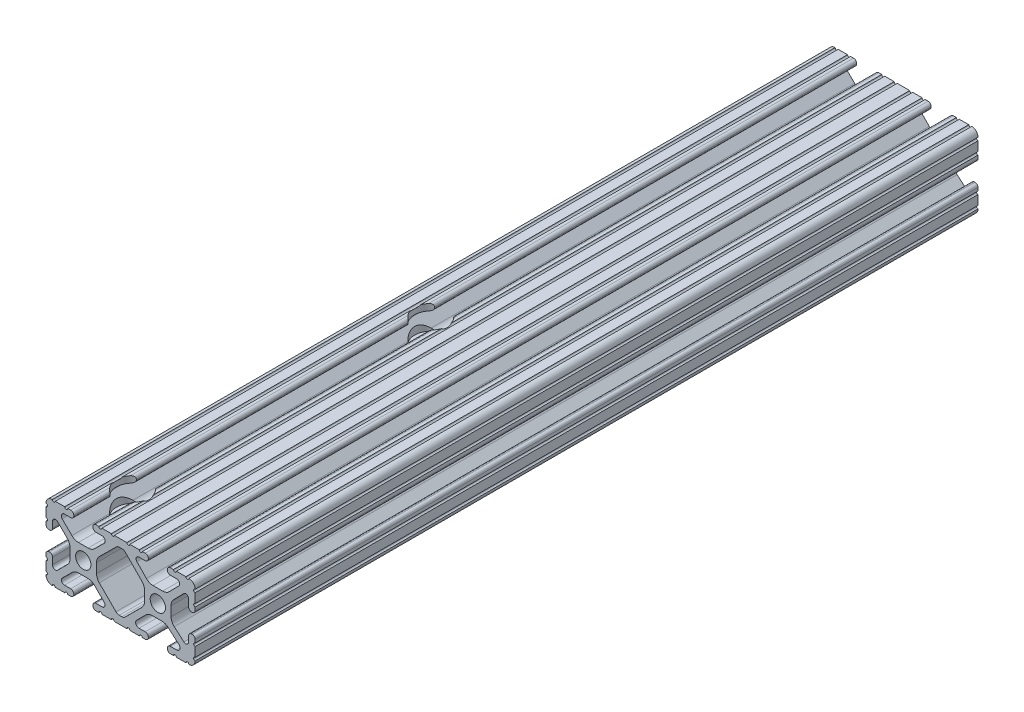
from build123d import *

# Parameters (mm, degrees)
SKETCH1_R                                        = 2.6035
BOSS_EXTRUDE1_DEPTH                              = 133.35
CBORE_FOR_1_4_SOCKET_HEAD_CAP_SCREW1_D           = 6.7564
CBORE_FOR_1_4_SOCKET_HEAD_CAP_SCREW1_CBORE_D     = 11.1125
CBORE_FOR_1_4_SOCKET_HEAD_CAP_SCREW1_CBORE_DEPTH = 8.2042


with BuildPart() as part:
    # Sketch1 → Boss-Extrude1 (new, symmetric)
    with BuildSketch(Plane.XY):
        with BuildLine():
            Line((18.01710265, 12.7), (16.98745015, 12.7))
            ThreePointArc((16.98745015, 12.7), (16.245730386, 12.392769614), (15.9385, 11.65104985))
            Line((15.9385, 11.65104985), (15.9385, 11.53922))
            ThreePointArc((15.9385, 11.53922), (16.245750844, 10.797450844), (16.98752, 10.4902))
            Line((16.98752, 10.4902), (19.116384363, 10.4902))
            ThreePointArc((19.116384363, 10.4902), (20.052502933, 9.869096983), (19.844087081, 8.765172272))
            Line((19.844087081, 8.765172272), (16.618993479, 5.455112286))
            ThreePointArc((16.618993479, 5.455112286), (15.578994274, 4.745442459), (14.344932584, 4.4958))
            Line((14.344932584, 4.4958), (11.083317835, 4.4958))
            ThreePointArc((11.083317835, 4.4958), (9.854330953, 4.743306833), (8.816955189, 5.447238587))
            Line((8.816955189, 5.447238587), (5.564154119, 8.762652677))
            ThreePointArc((5.564154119, 8.762652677), (5.352591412, 9.867473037), (6.289393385, 10.4902))
            Line((6.289393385, 10.4902), (8.41248, 10.4902))
            ThreePointArc((8.41248, 10.4902), (9.154249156, 10.797450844), (9.4615, 11.53922))
            Line((9.4615, 11.53922), (9.4615, 11.65104985))
            ThreePointArc((9.4615, 11.65104985), (9.154269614, 12.392769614), (8.41254985, 12.7))
            Line((8.41254985, 12.7), (7.38288465, 12.7))
            ThreePointArc((7.38288465, 12.7), (6.87488465, 12.192), (6.36688465, 12.7))
            Line((6.36688465, 12.7), (3.14958095, 12.7))
            ThreePointArc((3.14958095, 12.7), (2.64158095, 12.192), (2.13358095, 12.7))
            Line((2.13358095, 12.7), (-2.13358095, 12.7))
            ThreePointArc((-2.13358095, 12.7), (-2.64158095, 12.192), (-3.14958095, 12.7))
            Line((-3.14958095, 12.7), (-6.36689735, 12.7))
            ThreePointArc((-6.36689735, 12.7), (-6.87489735, 12.192), (-7.38289735, 12.7))
            Line((-7.38289735, 12.7), (-8.41254985, 12.7))
            ThreePointArc((-8.41254985, 12.7), (-9.154269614, 12.392769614), (-9.4615, 11.65104985))
            Line((-9.4615, 11.65104985), (-9.4615, 11.53922))
            ThreePointArc((-9.4615, 11.53922), (-9.154249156, 10.797450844), (-8.41248, 10.4902))
            Line((-8.41248, 10.4902), (-6.283641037, 10.4902))
            ThreePointArc((-6.283641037, 10.4902), (-5.297291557, 9.829633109), (-5.532576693, 8.666071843))
            Line((-5.532576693, 8.666071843), (-8.809985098, 5.416263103))
            ThreePointArc((-8.809985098, 5.416263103), (-9.836720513, 4.734920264), (-11.045536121, 4.4958))
            Line((-11.045536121, 4.4958), (-14.354463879, 4.4958))
            ThreePointArc((-14.354463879, 4.4958), (-15.563279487, 4.734920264), (-16.590014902, 5.416263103))
            Line((-16.590014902, 5.416263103), (-19.867423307, 8.666071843))
            ThreePointArc((-19.867423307, 8.666071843), (-20.102708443, 9.829633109), (-19.116358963, 10.4902))
            Line((-19.116358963, 10.4902), (-16.98752, 10.4902))
            ThreePointArc((-16.98752, 10.4902), (-16.245750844, 10.797450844), (-15.9385, 11.53922))
            Line((-15.9385, 11.53922), (-15.9385, 11.65104985))
            ThreePointArc((-15.9385, 11.65104985), (-16.245730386, 12.392769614), (-16.98745015, 12.7))
            Line((-16.98745015, 12.7), (-18.01711535, 12.7))
            ThreePointArc((-18.01711535, 12.7), (-18.52511535, 12.192), (-19.03311535, 12.7))
            Line((-19.03311535, 12.7), (-22.2504, 12.7))
            ThreePointArc((-22.2504, 12.7), (-22.758323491, 12.192000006), (-23.266399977, 12.699846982))
            ThreePointArc((-23.266399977, 12.699846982), (-24.782522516, 12.082522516), (-25.399846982, 10.566399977))
            ThreePointArc((-25.399846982, 10.566399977), (-24.892000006, 10.058323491), (-25.4, 9.5504))
            Line((-25.4, 9.5504), (-25.4, 6.3330836))
            ThreePointArc((-25.4, 6.3330836), (-24.892, 5.8250836), (-25.4, 5.3170836))
            Line((-25.4, 5.3170836), (-25.4, 4.237520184))
            ThreePointArc((-25.4, 4.237520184), (-25.107393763, 3.531106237), (-24.400979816, 3.2385))
            Line((-24.400979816, 3.2385), (-24.23922, 3.2385))
            ThreePointArc((-24.23922, 3.2385), (-23.497450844, 3.545750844), (-23.1902, 4.28752))
            Line((-23.1902, 4.28752), (-23.1902, 6.334741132))
            ThreePointArc((-23.1902, 6.334741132), (-22.556026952, 7.286023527), (-21.434002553, 7.066535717))
            Line((-21.434002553, 7.066535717), (-18.147950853, 3.808156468))
            ThreePointArc((-18.147950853, 3.808156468), (-17.452759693, 2.774838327), (-17.208501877, 1.553619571))
            Line((-17.208501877, 1.553619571), (-17.208501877, -1.695179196))
            ThreePointArc((-17.208501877, -1.695179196), (-17.450738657, -2.911536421), (-18.140486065, -3.942289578))
            Line((-18.140486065, -3.942289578), (-21.431579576, -7.227386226))
            ThreePointArc((-21.431579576, -7.227386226), (-22.55444896, -7.449940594), (-23.1902, -6.498002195))
            Line((-23.1902, -6.498002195), (-23.1902, -4.28752))
            ThreePointArc((-23.1902, -4.28752), (-23.497450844, -3.545750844), (-24.23922, -3.2385))
            Line((-24.23922, -3.2385), (-24.35098, -3.2385))
            ThreePointArc((-24.35098, -3.2385), (-25.092749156, -3.545750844), (-25.4, -4.28752))
            Line((-25.4, -4.28752), (-25.4, -5.3171344))
            ThreePointArc((-25.4, -5.3171344), (-24.892, -5.8251344), (-25.4, -6.3331344))
            Line((-25.4, -6.3331344), (-25.4, -9.5504))
            ThreePointArc((-25.4, -9.5504), (-24.892000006, -10.058323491), (-25.399846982, -10.566399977))
            ThreePointArc((-25.399846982, -10.566399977), (-24.782522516, -12.082522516), (-23.266399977, -12.699846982))
            ThreePointArc((-23.266399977, -12.699846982), (-22.758323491, -12.192000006), (-22.2504, -12.7))
            Line((-22.2504, -12.7), (-19.03308995, -12.7))
            ThreePointArc((-19.03308995, -12.7), (-18.52508995, -12.192), (-18.01708995, -12.7))
            Line((-18.01708995, -12.7), (-16.9874692, -12.7))
            ThreePointArc((-16.9874692, -12.7), (-16.245700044, -12.392749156), (-15.9384492, -11.65098))
            Line((-15.9384492, -11.65098), (-15.9384492, -11.53922))
            ThreePointArc((-15.9384492, -11.53922), (-16.245700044, -10.797450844), (-16.9874692, -10.4902))
            Line((-16.9874692, -10.4902), (-19.116358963, -10.4902))
            ThreePointArc((-19.116358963, -10.4902), (-20.055197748, -9.862578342), (-19.834124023, -8.755124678))
            Line((-19.834124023, -8.755124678), (-16.49660751, -5.423689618))
            ThreePointArc((-16.49660751, -5.423689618), (-15.467274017, -4.736928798), (-14.253591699, -4.4958))
            Line((-14.253591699, -4.4958), (-11.146408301, -4.4958))
            ThreePointArc((-11.146408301, -4.4958), (-9.932725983, -4.736928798), (-8.90339249, -5.423689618))
            Line((-8.90339249, -5.423689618), (-5.565875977, -8.755124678))
            ThreePointArc((-5.565875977, -8.755124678), (-5.344802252, -9.862578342), (-6.283641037, -10.4902))
            Line((-6.283641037, -10.4902), (-8.4125308, -10.4902))
            ThreePointArc((-8.4125308, -10.4902), (-9.154299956, -10.797450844), (-9.4615508, -11.53922))
            Line((-9.4615508, -11.53922), (-9.4615508, -11.65098))
            ThreePointArc((-9.4615508, -11.65098), (-9.154299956, -12.392749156), (-8.4125308, -12.7))
            Line((-8.4125308, -12.7), (-7.38287195, -12.7))
            ThreePointArc((-7.38287195, -12.7), (-6.87487195, -12.192), (-6.36687195, -12.7))
            Line((-6.36687195, -12.7), (-3.14960635, -12.7))
            ThreePointArc((-3.14960635, -12.7), (-2.64160635, -12.192), (-2.13360635, -12.7))
            Line((-2.13360635, -12.7), (2.13360635, -12.7))
            ThreePointArc((2.13360635, -12.7), (2.64159365, -12.1920127), (3.14958095, -12.7))
            Line((3.14958095, -12.7), (6.36691005, -12.7))
            ThreePointArc((6.36691005, -12.7), (6.87491005, -12.192), (7.38291005, -12.7))
            Line((7.38291005, -12.7), (8.4125308, -12.7))
            ThreePointArc((8.4125308, -12.7), (9.154299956, -12.392749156), (9.4615508, -11.65098))
            Line((9.4615508, -11.65098), (9.4615508, -11.53922))
            ThreePointArc((9.4615508, -11.53922), (9.154299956, -10.797450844), (8.4125308, -10.4902))
            Line((8.4125308, -10.4902), (6.289393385, -10.4902))
            ThreePointArc((6.289393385, -10.4902), (5.231590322, -9.783049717), (5.480677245, -8.535265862))
            Line((5.480677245, -8.535265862), (8.597933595, -5.423689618))
            ThreePointArc((8.597933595, -5.423689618), (9.627267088, -4.736928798), (10.840949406, -4.4958))
            Line((10.840949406, -4.4958), (14.102564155, -4.4958))
            ThreePointArc((14.102564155, -4.4958), (15.215927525, -4.697410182), (16.187895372, -5.276636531))
            Line((16.187895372, -5.276636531), (19.868247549, -8.482246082))
            ThreePointArc((19.868247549, -8.482246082), (20.188435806, -9.746879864), (19.116384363, -10.4902))
            Line((19.116384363, -10.4902), (16.9874692, -10.4902))
            ThreePointArc((16.9874692, -10.4902), (16.245700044, -10.797450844), (15.9384492, -11.53922))
            Line((15.9384492, -11.53922), (15.9384492, -11.65098))
            ThreePointArc((15.9384492, -11.65098), (16.245700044, -12.392749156), (16.9874692, -12.7))
            Line((16.9874692, -12.7), (18.01710265, -12.7))
            ThreePointArc((18.01710265, -12.7), (18.52510265, -12.192), (19.03310265, -12.7))
            Line((19.03310265, -12.7), (22.2504, -12.7))
            ThreePointArc((22.2504, -12.7), (22.758323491, -12.192000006), (23.266399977, -12.699846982))
            ThreePointArc((23.266399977, -12.699846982), (24.782522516, -12.082522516), (25.399846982, -10.566399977))
            ThreePointArc((25.399846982, -10.566399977), (24.892000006, -10.058323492), (25.4, -9.550400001))
            Line((25.4, -9.550400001), (25.4, -6.333083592))
            ThreePointArc((25.4, -6.333083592), (24.892000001, -5.825083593), (25.4, -5.317083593))
            Line((25.4, -5.317083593), (25.4, -4.237520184))
            ThreePointArc((25.4, -4.237520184), (25.107393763, -3.531106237), (24.400979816, -3.2385))
            Line((24.400979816, -3.2385), (24.189220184, -3.2385))
            ThreePointArc((24.189220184, -3.2385), (23.482806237, -3.531106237), (23.1902, -4.237520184))
            Line((23.1902, -4.237520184), (23.1902, -6.155876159))
            ThreePointArc((23.1902, -6.155876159), (22.62232736, -7.038258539), (21.583974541, -6.886926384))
            Line((21.583974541, -6.886926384), (18.29817066, -4.024970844))
            ThreePointArc((18.29817066, -4.024970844), (17.493730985, -2.946044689), (17.208501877, -1.630807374))
            Line((17.208501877, -1.630807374), (17.208501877, 1.630807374))
            ThreePointArc((17.208501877, 1.630807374), (17.442348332, 2.82673414), (18.109440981, 3.846495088))
            Line((18.109440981, 3.846495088), (21.526346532, 7.353420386))
            ThreePointArc((21.526346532, 7.353420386), (22.585896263, 7.574939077), (23.1902, 6.676867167))
            Line((23.1902, 6.676867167), (23.1902, 4.237520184))
            ThreePointArc((23.1902, 4.237520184), (23.482806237, 3.531106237), (24.189220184, 3.2385))
            Line((24.189220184, 3.2385), (24.400979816, 3.2385))
            ThreePointArc((24.400979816, 3.2385), (25.107393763, 3.531106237), (25.4, 4.237520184))
            Line((25.4, 4.237520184), (25.4, 5.3170836))
            ThreePointArc((25.4, 5.3170836), (24.891949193, 5.825134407), (25.4, 6.333185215))
            Line((25.4, 6.333185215), (25.4, 9.550400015))
            ThreePointArc((25.4, 9.550400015), (24.892000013, 10.058323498), (25.399846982, 10.566399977))
            ThreePointArc((25.399846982, 10.566399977), (24.782522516, 12.082522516), (23.266399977, 12.699846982))
            ThreePointArc((23.266399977, 12.699846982), (22.758323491, 12.192000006), (22.2504, 12.7))
            Line((22.2504, 12.7), (19.03310265, 12.7))
            ThreePointArc((19.03310265, 12.7), (18.52510265, 12.192), (18.01710265, 12.7))
        make_face()
        with Locations((-12.7, 0)):
            Circle(SKETCH1_R, mode=Mode.SUBTRACT)
        with Locations((12.7, 0)):
            Circle(SKETCH1_R, mode=Mode.SUBTRACT)
        with BuildLine():
            Line((-7.259513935, -3.869413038), (-1.545748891, -9.572766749))
            ThreePointArc((-1.545748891, -9.572766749), (-1.035199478, -9.913400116), (-0.433213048, -10.033))
            Line((-0.433213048, -10.033), (0.433213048, -10.033))
            ThreePointArc((0.433213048, -10.033), (1.035199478, -9.913400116), (1.545748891, -9.572766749))
            Line((1.545748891, -9.572766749), (7.259513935, -3.869413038))
            ThreePointArc((7.259513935, -3.869413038), (7.949261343, -2.838659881), (8.191498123, -1.622302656))
            Line((8.191498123, -1.622302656), (8.191498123, 1.622302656))
            ThreePointArc((8.191498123, 1.622302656), (7.955573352, 2.823327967), (7.282860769, 3.845864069))
            Line((7.282860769, 3.845864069), (1.675572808, 9.561086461))
            ThreePointArc((1.675572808, 9.561086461), (1.161034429, 9.910236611), (0.551456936, 10.033))
            Line((0.551456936, 10.033), (-0.395199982, 10.033))
            ThreePointArc((-0.395199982, 10.033), (-0.994772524, 9.914396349), (-1.50403329, 9.576450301))
            Line((-1.50403329, 9.576450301), (-7.252049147, 3.876839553))
            ThreePointArc((-7.252049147, 3.876839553), (-7.947240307, 2.843521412), (-8.191498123, 1.622302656))
            Line((-8.191498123, 1.622302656), (-8.191498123, -1.622302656))
            ThreePointArc((-8.191498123, -1.622302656), (-7.949261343, -2.838659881), (-7.259513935, -3.869413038))
        make_face(mode=Mode.SUBTRACT)
    extrude(amount=BOSS_EXTRUDE1_DEPTH, both=True)

    # CBORE for 1_4 Socket Head Cap Screw1 (through all)
    with Locations(Plane(origin=(0, 12.7, 0), x_dir=(1, 0, 0), z_dir=(0, 1, 0))):
        with Locations((-12.7, -116.5352), (-12.7, -14.9352)):
            CounterBoreHole(CBORE_FOR_1_4_SOCKET_HEAD_CAP_SCREW1_D / 2, CBORE_FOR_1_4_SOCKET_HEAD_CAP_SCREW1_CBORE_D / 2, CBORE_FOR_1_4_SOCKET_HEAD_CAP_SCREW1_CBORE_DEPTH)


solid = part.part
